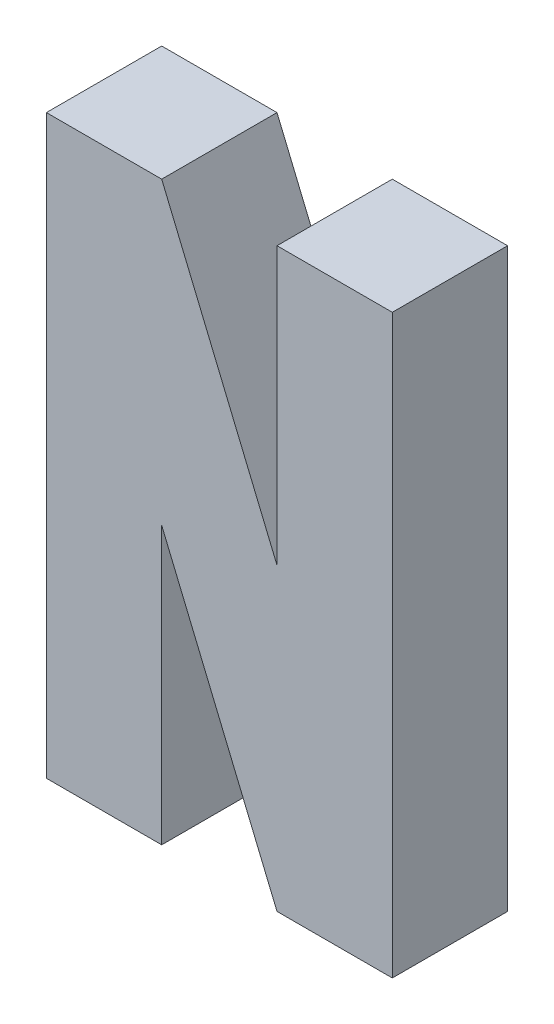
ISO-10303-21;
HEADER;
FILE_DESCRIPTION(('STEP AP214'),'2;1');
FILE_NAME('part.step','',(''),(''),'','','');
FILE_SCHEMA(('AUTOMOTIVE_DESIGN { 1 0 10303 214 1 1 1 1 }'));
ENDSEC;
DATA;
#1=APPLICATION_CONTEXT('core data for automotive mechanical design processes');
#2=APPLICATION_PROTOCOL_DEFINITION('international standard','automotive_design',2000,#1);
#3=PRODUCT_CONTEXT('',#1,'mechanical');
#4=PRODUCT('Part','Part','',(#3));
#5=PRODUCT_RELATED_PRODUCT_CATEGORY('part','',(#4));
#6=PRODUCT_DEFINITION_FORMATION('','',#4);
#7=PRODUCT_DEFINITION_CONTEXT('part definition',#1,'design');
#8=PRODUCT_DEFINITION('design','',#6,#7);
#9=PRODUCT_DEFINITION_SHAPE('','',#8);
#10=(LENGTH_UNIT() NAMED_UNIT(*) SI_UNIT(.MILLI.,.METRE.));
#11=(NAMED_UNIT(*) PLANE_ANGLE_UNIT() SI_UNIT($,.RADIAN.));
#12=(NAMED_UNIT(*) SI_UNIT($,.STERADIAN.) SOLID_ANGLE_UNIT());
#13=UNCERTAINTY_MEASURE_WITH_UNIT(LENGTH_MEASURE(1.E-05),#10,'distance_accuracy_value','');
#14=(GEOMETRIC_REPRESENTATION_CONTEXT(3) GLOBAL_UNCERTAINTY_ASSIGNED_CONTEXT((#13)) GLOBAL_UNIT_ASSIGNED_CONTEXT((#10,
#11,#12)) REPRESENTATION_CONTEXT('',''));
#15=CARTESIAN_POINT('',(0.,0.,0.));
#16=DIRECTION('',(0.,0.,1.));
#17=DIRECTION('',(1.,0.,0.));
#18=AXIS2_PLACEMENT_3D('',#15,#16,#17);
#19=CARTESIAN_POINT('',(0.,0.,10.));
#20=DIRECTION('',(1.,0.,0.));
#21=DIRECTION('',(0.,0.,-1.));
#22=AXIS2_PLACEMENT_3D('',#19,#20,#21);
#23=PLANE('',#22);
#24=DIRECTION('',(0.,-1.,0.));
#25=VECTOR('',#24,1.);
#26=CARTESIAN_POINT('',(0.,0.,0.));
#27=LINE('',#26,#25);
#28=CARTESIAN_POINT('',(0.,50.,0.));
#29=VERTEX_POINT('',#28);
#30=CARTESIAN_POINT('',(0.,0.,0.));
#31=VERTEX_POINT('',#30);
#32=EDGE_CURVE('E141',#29,#31,#27,.T.);
#33=ORIENTED_EDGE('',*,*,#32,.T.);
#34=DIRECTION('',(0.,0.,-1.));
#35=VECTOR('',#34,1.);
#36=CARTESIAN_POINT('',(0.,0.,10.));
#37=LINE('',#36,#35);
#38=CARTESIAN_POINT('',(0.,0.,10.));
#39=VERTEX_POINT('',#38);
#40=EDGE_CURVE('E11',#39,#31,#37,.T.);
#41=ORIENTED_EDGE('',*,*,#40,.F.);
#42=DIRECTION('',(0.,-1.,0.));
#43=VECTOR('',#42,1.);
#44=CARTESIAN_POINT('',(0.,0.,10.));
#45=LINE('',#44,#43);
#46=CARTESIAN_POINT('',(0.,50.,10.));
#47=VERTEX_POINT('',#46);
#48=EDGE_CURVE('E159',#47,#39,#45,.T.);
#49=ORIENTED_EDGE('',*,*,#48,.F.);
#50=DIRECTION('',(0.,0.,-1.));
#51=VECTOR('',#50,1.);
#52=CARTESIAN_POINT('',(0.,50.,10.));
#53=LINE('',#52,#51);
#54=EDGE_CURVE('E137',#47,#29,#53,.T.);
#55=ORIENTED_EDGE('',*,*,#54,.T.);
#56=EDGE_LOOP('',(#33,#41,#49,#55));
#57=FACE_BOUND('',#56,.T.);
#58=ADVANCED_FACE('F33',(#57),#23,.F.);
#59=CARTESIAN_POINT('',(0.,0.,10.));
#60=DIRECTION('',(0.,1.,0.));
#61=DIRECTION('',(0.,0.,1.));
#62=AXIS2_PLACEMENT_3D('',#59,#60,#61);
#63=PLANE('',#62);
#64=DIRECTION('',(1.,0.,0.));
#65=VECTOR('',#64,1.);
#66=CARTESIAN_POINT('',(0.,0.,0.));
#67=LINE('',#66,#65);
#68=CARTESIAN_POINT('',(10.,0.,0.));
#69=VERTEX_POINT('',#68);
#70=EDGE_CURVE('E144',#31,#69,#67,.T.);
#71=ORIENTED_EDGE('',*,*,#70,.T.);
#72=DIRECTION('',(0.,0.,-1.));
#73=VECTOR('',#72,1.);
#74=CARTESIAN_POINT('',(10.,0.,10.));
#75=LINE('',#74,#73);
#76=CARTESIAN_POINT('',(10.,0.,10.));
#77=VERTEX_POINT('',#76);
#78=EDGE_CURVE('E41',#77,#69,#75,.T.);
#79=ORIENTED_EDGE('',*,*,#78,.F.);
#80=DIRECTION('',(1.,0.,0.));
#81=VECTOR('',#80,1.);
#82=CARTESIAN_POINT('',(0.,0.,10.));
#83=LINE('',#82,#81);
#84=EDGE_CURVE('E98',#39,#77,#83,.T.);
#85=ORIENTED_EDGE('',*,*,#84,.F.);
#86=ORIENTED_EDGE('',*,*,#40,.T.);
#87=EDGE_LOOP('',(#71,#79,#85,#86));
#88=FACE_BOUND('',#87,.T.);
#89=ADVANCED_FACE('F208',(#88),#63,.F.);
#90=CARTESIAN_POINT('',(10.,0.,10.));
#91=DIRECTION('',(-1.,0.,0.));
#92=DIRECTION('',(0.,-1.,0.));
#93=AXIS2_PLACEMENT_3D('',#90,#91,#92);
#94=PLANE('',#93);
#95=DIRECTION('',(0.,1.,0.));
#96=VECTOR('',#95,1.);
#97=CARTESIAN_POINT('',(10.,0.,0.));
#98=LINE('',#97,#96);
#99=CARTESIAN_POINT('',(10.,24.,0.));
#100=VERTEX_POINT('',#99);
#101=EDGE_CURVE('E146',#69,#100,#98,.T.);
#102=ORIENTED_EDGE('',*,*,#101,.T.);
#103=DIRECTION('',(0.,0.,-1.));
#104=VECTOR('',#103,1.);
#105=CARTESIAN_POINT('',(10.,24.,10.));
#106=LINE('',#105,#104);
#107=CARTESIAN_POINT('',(10.,24.,10.));
#108=VERTEX_POINT('',#107);
#109=EDGE_CURVE('E172',#108,#100,#106,.T.);
#110=ORIENTED_EDGE('',*,*,#109,.F.);
#111=DIRECTION('',(0.,1.,0.));
#112=VECTOR('',#111,1.);
#113=CARTESIAN_POINT('',(10.,0.,10.));
#114=LINE('',#113,#112);
#115=EDGE_CURVE('E180',#77,#108,#114,.T.);
#116=ORIENTED_EDGE('',*,*,#115,.F.);
#117=ORIENTED_EDGE('',*,*,#78,.T.);
#118=EDGE_LOOP('',(#102,#110,#116,#117));
#119=FACE_BOUND('',#118,.T.);
#120=ADVANCED_FACE('F178',(#119),#94,.F.);
#121=CARTESIAN_POINT('',(20.,0.,10.));
#122=DIRECTION('',(0.923076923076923,0.384615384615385,0.));
#123=DIRECTION('',(-0.384615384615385,0.923076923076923,0.));
#124=AXIS2_PLACEMENT_3D('',#121,#122,#123);
#125=PLANE('',#124);
#126=DIRECTION('',(0.384615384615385,-0.923076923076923,0.));
#127=VECTOR('',#126,1.);
#128=CARTESIAN_POINT('',(20.,0.,0.));
#129=LINE('',#128,#127);
#130=CARTESIAN_POINT('',(20.,0.,0.));
#131=VERTEX_POINT('',#130);
#132=EDGE_CURVE('E148',#100,#131,#129,.T.);
#133=ORIENTED_EDGE('',*,*,#132,.T.);
#134=DIRECTION('',(0.,0.,-1.));
#135=VECTOR('',#134,1.);
#136=CARTESIAN_POINT('',(20.,0.,10.));
#137=LINE('',#136,#135);
#138=CARTESIAN_POINT('',(20.,0.,10.));
#139=VERTEX_POINT('',#138);
#140=EDGE_CURVE('E169',#139,#131,#137,.T.);
#141=ORIENTED_EDGE('',*,*,#140,.F.);
#142=DIRECTION('',(0.384615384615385,-0.923076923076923,0.));
#143=VECTOR('',#142,1.);
#144=CARTESIAN_POINT('',(20.,0.,10.));
#145=LINE('',#144,#143);
#146=EDGE_CURVE('E198',#108,#139,#145,.T.);
#147=ORIENTED_EDGE('',*,*,#146,.F.);
#148=ORIENTED_EDGE('',*,*,#109,.T.);
#149=EDGE_LOOP('',(#133,#141,#147,#148));
#150=FACE_BOUND('',#149,.T.);
#151=ADVANCED_FACE('F189',(#150),#125,.F.);
#152=CARTESIAN_POINT('',(20.,0.,10.));
#153=DIRECTION('',(0.,1.,0.));
#154=DIRECTION('',(0.,0.,1.));
#155=AXIS2_PLACEMENT_3D('',#152,#153,#154);
#156=PLANE('',#155);
#157=DIRECTION('',(1.,0.,0.));
#158=VECTOR('',#157,1.);
#159=CARTESIAN_POINT('',(20.,0.,0.));
#160=LINE('',#159,#158);
#161=CARTESIAN_POINT('',(30.,0.,0.));
#162=VERTEX_POINT('',#161);
#163=EDGE_CURVE('E150',#131,#162,#160,.T.);
#164=ORIENTED_EDGE('',*,*,#163,.T.);
#165=DIRECTION('',(0.,0.,-1.));
#166=VECTOR('',#165,1.);
#167=CARTESIAN_POINT('',(30.,0.,10.));
#168=LINE('',#167,#166);
#169=CARTESIAN_POINT('',(30.,0.,10.));
#170=VERTEX_POINT('',#169);
#171=EDGE_CURVE('E166',#170,#162,#168,.T.);
#172=ORIENTED_EDGE('',*,*,#171,.F.);
#173=DIRECTION('',(1.,0.,0.));
#174=VECTOR('',#173,1.);
#175=CARTESIAN_POINT('',(20.,0.,10.));
#176=LINE('',#175,#174);
#177=EDGE_CURVE('E195',#139,#170,#176,.T.);
#178=ORIENTED_EDGE('',*,*,#177,.F.);
#179=ORIENTED_EDGE('',*,*,#140,.T.);
#180=EDGE_LOOP('',(#164,#172,#178,#179));
#181=FACE_BOUND('',#180,.T.);
#182=ADVANCED_FACE('F193',(#181),#156,.F.);
#183=CARTESIAN_POINT('',(30.,50.,10.));
#184=DIRECTION('',(-1.,0.,0.));
#185=DIRECTION('',(0.,-1.,0.));
#186=AXIS2_PLACEMENT_3D('',#183,#184,#185);
#187=PLANE('',#186);
#188=DIRECTION('',(0.,1.,0.));
#189=VECTOR('',#188,1.);
#190=CARTESIAN_POINT('',(30.,50.,0.));
#191=LINE('',#190,#189);
#192=CARTESIAN_POINT('',(30.,50.,0.));
#193=VERTEX_POINT('',#192);
#194=EDGE_CURVE('E152',#162,#193,#191,.T.);
#195=ORIENTED_EDGE('',*,*,#194,.T.);
#196=DIRECTION('',(0.,0.,-1.));
#197=VECTOR('',#196,1.);
#198=CARTESIAN_POINT('',(30.,50.,10.));
#199=LINE('',#198,#197);
#200=CARTESIAN_POINT('',(30.,50.,10.));
#201=VERTEX_POINT('',#200);
#202=EDGE_CURVE('E163',#201,#193,#199,.T.);
#203=ORIENTED_EDGE('',*,*,#202,.F.);
#204=DIRECTION('',(0.,1.,0.));
#205=VECTOR('',#204,1.);
#206=CARTESIAN_POINT('',(30.,50.,10.));
#207=LINE('',#206,#205);
#208=EDGE_CURVE('E197',#170,#201,#207,.T.);
#209=ORIENTED_EDGE('',*,*,#208,.F.);
#210=ORIENTED_EDGE('',*,*,#171,.T.);
#211=EDGE_LOOP('',(#195,#203,#209,#210));
#212=FACE_BOUND('',#211,.T.);
#213=ADVANCED_FACE('F220',(#212),#187,.F.);
#214=CARTESIAN_POINT('',(20.,50.,10.));
#215=DIRECTION('',(0.,-1.,0.));
#216=DIRECTION('',(0.,0.,-1.));
#217=AXIS2_PLACEMENT_3D('',#214,#215,#216);
#218=PLANE('',#217);
#219=DIRECTION('',(-1.,0.,0.));
#220=VECTOR('',#219,1.);
#221=CARTESIAN_POINT('',(20.,50.,0.));
#222=LINE('',#221,#220);
#223=CARTESIAN_POINT('',(20.,50.,0.));
#224=VERTEX_POINT('',#223);
#225=EDGE_CURVE('E154',#193,#224,#222,.T.);
#226=ORIENTED_EDGE('',*,*,#225,.T.);
#227=DIRECTION('',(0.,0.,-1.));
#228=VECTOR('',#227,1.);
#229=CARTESIAN_POINT('',(20.,50.,10.));
#230=LINE('',#229,#228);
#231=CARTESIAN_POINT('',(20.,50.,10.));
#232=VERTEX_POINT('',#231);
#233=EDGE_CURVE('E132',#232,#224,#230,.T.);
#234=ORIENTED_EDGE('',*,*,#233,.F.);
#235=DIRECTION('',(-1.,0.,0.));
#236=VECTOR('',#235,1.);
#237=CARTESIAN_POINT('',(20.,50.,10.));
#238=LINE('',#237,#236);
#239=EDGE_CURVE('E123',#201,#232,#238,.T.);
#240=ORIENTED_EDGE('',*,*,#239,.F.);
#241=ORIENTED_EDGE('',*,*,#202,.T.);
#242=EDGE_LOOP('',(#226,#234,#240,#241));
#243=FACE_BOUND('',#242,.T.);
#244=ADVANCED_FACE('F223',(#243),#218,.F.);
#245=CARTESIAN_POINT('',(20.,50.,10.));
#246=DIRECTION('',(1.,0.,0.));
#247=DIRECTION('',(0.,0.,-1.));
#248=AXIS2_PLACEMENT_3D('',#245,#246,#247);
#249=PLANE('',#248);
#250=DIRECTION('',(0.,-1.,0.));
#251=VECTOR('',#250,1.);
#252=CARTESIAN_POINT('',(20.,50.,0.));
#253=LINE('',#252,#251);
#254=CARTESIAN_POINT('',(20.,26.,0.));
#255=VERTEX_POINT('',#254);
#256=EDGE_CURVE('E131',#224,#255,#253,.T.);
#257=ORIENTED_EDGE('',*,*,#256,.T.);
#258=DIRECTION('',(0.,0.,-1.));
#259=VECTOR('',#258,1.);
#260=CARTESIAN_POINT('',(20.,26.,10.));
#261=LINE('',#260,#259);
#262=CARTESIAN_POINT('',(20.,26.,10.));
#263=VERTEX_POINT('',#262);
#264=EDGE_CURVE('E128',#263,#255,#261,.T.);
#265=ORIENTED_EDGE('',*,*,#264,.F.);
#266=DIRECTION('',(0.,-1.,0.));
#267=VECTOR('',#266,1.);
#268=CARTESIAN_POINT('',(20.,50.,10.));
#269=LINE('',#268,#267);
#270=EDGE_CURVE('E117',#232,#263,#269,.T.);
#271=ORIENTED_EDGE('',*,*,#270,.F.);
#272=ORIENTED_EDGE('',*,*,#233,.T.);
#273=EDGE_LOOP('',(#257,#265,#271,#272));
#274=FACE_BOUND('',#273,.T.);
#275=ADVANCED_FACE('F129',(#274),#249,.F.);
#276=CARTESIAN_POINT('',(10.,50.,10.));
#277=DIRECTION('',(-0.923076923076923,-0.384615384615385,0.));
#278=DIRECTION('',(0.384615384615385,-0.923076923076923,0.));
#279=AXIS2_PLACEMENT_3D('',#276,#277,#278);
#280=PLANE('',#279);
#281=DIRECTION('',(-0.384615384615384,0.923076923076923,0.));
#282=VECTOR('',#281,1.);
#283=CARTESIAN_POINT('',(10.,50.,0.));
#284=LINE('',#283,#282);
#285=CARTESIAN_POINT('',(10.,50.,0.));
#286=VERTEX_POINT('',#285);
#287=EDGE_CURVE('E84',#255,#286,#284,.T.);
#288=ORIENTED_EDGE('',*,*,#287,.T.);
#289=DIRECTION('',(0.,0.,-1.));
#290=VECTOR('',#289,1.);
#291=CARTESIAN_POINT('',(10.,50.,10.));
#292=LINE('',#291,#290);
#293=CARTESIAN_POINT('',(10.,50.,10.));
#294=VERTEX_POINT('',#293);
#295=EDGE_CURVE('E133',#294,#286,#292,.T.);
#296=ORIENTED_EDGE('',*,*,#295,.F.);
#297=DIRECTION('',(-0.384615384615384,0.923076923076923,0.));
#298=VECTOR('',#297,1.);
#299=CARTESIAN_POINT('',(10.,50.,10.));
#300=LINE('',#299,#298);
#301=EDGE_CURVE('E121',#263,#294,#300,.T.);
#302=ORIENTED_EDGE('',*,*,#301,.F.);
#303=ORIENTED_EDGE('',*,*,#264,.T.);
#304=EDGE_LOOP('',(#288,#296,#302,#303));
#305=FACE_BOUND('',#304,.T.);
#306=ADVANCED_FACE('F135',(#305),#280,.F.);
#307=CARTESIAN_POINT('',(0.,50.,10.));
#308=DIRECTION('',(0.,-1.,0.));
#309=DIRECTION('',(0.,0.,-1.));
#310=AXIS2_PLACEMENT_3D('',#307,#308,#309);
#311=PLANE('',#310);
#312=DIRECTION('',(-1.,0.,0.));
#313=VECTOR('',#312,1.);
#314=CARTESIAN_POINT('',(0.,50.,0.));
#315=LINE('',#314,#313);
#316=EDGE_CURVE('E90',#286,#29,#315,.T.);
#317=ORIENTED_EDGE('',*,*,#316,.T.);
#318=ORIENTED_EDGE('',*,*,#54,.F.);
#319=DIRECTION('',(-1.,0.,0.));
#320=VECTOR('',#319,1.);
#321=CARTESIAN_POINT('',(0.,50.,10.));
#322=LINE('',#321,#320);
#323=EDGE_CURVE('E49',#294,#47,#322,.T.);
#324=ORIENTED_EDGE('',*,*,#323,.F.);
#325=ORIENTED_EDGE('',*,*,#295,.T.);
#326=EDGE_LOOP('',(#317,#318,#324,#325));
#327=FACE_BOUND('',#326,.T.);
#328=ADVANCED_FACE('F232',(#327),#311,.F.);
#329=CARTESIAN_POINT('',(0.,0.,10.));
#330=DIRECTION('',(0.,0.,-1.));
#331=DIRECTION('',(-1.,0.,0.));
#332=AXIS2_PLACEMENT_3D('',#329,#330,#331);
#333=PLANE('',#332);
#334=ORIENTED_EDGE('',*,*,#48,.T.);
#335=ORIENTED_EDGE('',*,*,#84,.T.);
#336=ORIENTED_EDGE('',*,*,#115,.T.);
#337=ORIENTED_EDGE('',*,*,#146,.T.);
#338=ORIENTED_EDGE('',*,*,#177,.T.);
#339=ORIENTED_EDGE('',*,*,#208,.T.);
#340=ORIENTED_EDGE('',*,*,#239,.T.);
#341=ORIENTED_EDGE('',*,*,#270,.T.);
#342=ORIENTED_EDGE('',*,*,#301,.T.);
#343=ORIENTED_EDGE('',*,*,#323,.T.);
#344=EDGE_LOOP('',(#334,#335,#336,#337,#338,#339,#340,#341,#342,#343));
#345=FACE_BOUND('',#344,.T.);
#346=ADVANCED_FACE('F119',(#345),#333,.F.);
#347=CARTESIAN_POINT('',(0.,0.,0.));
#348=DIRECTION('',(0.,0.,-1.));
#349=DIRECTION('',(-1.,0.,0.));
#350=AXIS2_PLACEMENT_3D('',#347,#348,#349);
#351=PLANE('',#350);
#352=ORIENTED_EDGE('',*,*,#32,.F.);
#353=ORIENTED_EDGE('',*,*,#316,.F.);
#354=ORIENTED_EDGE('',*,*,#287,.F.);
#355=ORIENTED_EDGE('',*,*,#256,.F.);
#356=ORIENTED_EDGE('',*,*,#225,.F.);
#357=ORIENTED_EDGE('',*,*,#194,.F.);
#358=ORIENTED_EDGE('',*,*,#163,.F.);
#359=ORIENTED_EDGE('',*,*,#132,.F.);
#360=ORIENTED_EDGE('',*,*,#101,.F.);
#361=ORIENTED_EDGE('',*,*,#70,.F.);
#362=EDGE_LOOP('',(#352,#353,#354,#355,#356,#357,#358,#359,#360,#361));
#363=FACE_BOUND('',#362,.T.);
#364=ADVANCED_FACE('F184',(#363),#351,.T.);
#365=CLOSED_SHELL('',(#58,#89,#120,#151,#182,#213,#244,#275,#306,#328,#346,#364));
#366=MANIFOLD_SOLID_BREP('B2',#365);
#367=ADVANCED_BREP_SHAPE_REPRESENTATION('',(#18,#366),#14);
#368=SHAPE_DEFINITION_REPRESENTATION(#9,#367);
ENDSEC;
END-ISO-10303-21;
